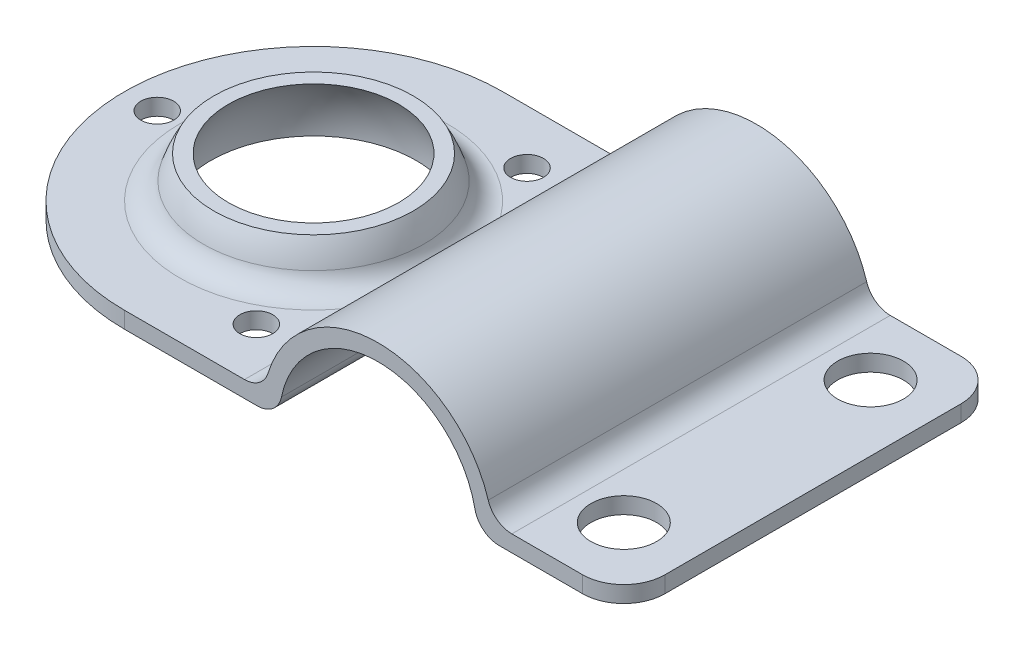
ISO-10303-21;
HEADER;
FILE_DESCRIPTION(('STEP AP214'),'2;1');
FILE_NAME('part.step','',(''),(''),'','','');
FILE_SCHEMA(('AUTOMOTIVE_DESIGN { 1 0 10303 214 1 1 1 1 }'));
ENDSEC;
DATA;
#1=APPLICATION_CONTEXT('core data for automotive mechanical design processes');
#2=APPLICATION_PROTOCOL_DEFINITION('international standard','automotive_design',2000,#1);
#3=PRODUCT_CONTEXT('',#1,'mechanical');
#4=PRODUCT('Part','Part','',(#3));
#5=PRODUCT_RELATED_PRODUCT_CATEGORY('part','',(#4));
#6=PRODUCT_DEFINITION_FORMATION('','',#4);
#7=PRODUCT_DEFINITION_CONTEXT('part definition',#1,'design');
#8=PRODUCT_DEFINITION('design','',#6,#7);
#9=PRODUCT_DEFINITION_SHAPE('','',#8);
#10=(LENGTH_UNIT() NAMED_UNIT(*) SI_UNIT(.MILLI.,.METRE.));
#11=(NAMED_UNIT(*) PLANE_ANGLE_UNIT() SI_UNIT($,.RADIAN.));
#12=(NAMED_UNIT(*) SI_UNIT($,.STERADIAN.) SOLID_ANGLE_UNIT());
#13=UNCERTAINTY_MEASURE_WITH_UNIT(LENGTH_MEASURE(1.E-05),#10,'distance_accuracy_value','');
#14=(GEOMETRIC_REPRESENTATION_CONTEXT(3) GLOBAL_UNCERTAINTY_ASSIGNED_CONTEXT((#13)) GLOBAL_UNIT_ASSIGNED_CONTEXT((#10,
#11,#12)) REPRESENTATION_CONTEXT('',''));
#15=CARTESIAN_POINT('',(0.,0.,0.));
#16=DIRECTION('',(0.,0.,1.));
#17=DIRECTION('',(1.,0.,0.));
#18=AXIS2_PLACEMENT_3D('',#15,#16,#17);
#19=CARTESIAN_POINT('',(-31.0174437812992,-2.0000000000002,23.));
#20=DIRECTION('',(-1.00000000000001,0.,0.));
#21=DIRECTION('',(0.,0.,-1.));
#22=AXIS2_PLACEMENT_3D('',#19,#20,#21);
#23=SPHERICAL_SURFACE('',#22,14.);
#24=CARTESIAN_POINT('',(-31.0174437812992,-2.0000000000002,23.));
#25=DIRECTION('',(0.,-1.,0.));
#26=DIRECTION('',(0.,0.,-1.));
#27=AXIS2_PLACEMENT_3D('',#24,#25,#26);
#28=SPHERICAL_SURFACE('',#27,14.);
#29=CARTESIAN_POINT('',(-31.0174437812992,2.11764705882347,22.9999999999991));
#30=DIRECTION('',(0.,-1.00000000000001,0.));
#31=DIRECTION('',(0.,0.,-1.));
#32=AXIS2_PLACEMENT_3D('',#29,#30,#31);
#33=CIRCLE('',#32,13.3807691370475);
#34=CARTESIAN_POINT('',(-31.0174437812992,2.11764705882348,9.61923086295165));
#35=VERTEX_POINT('',#34);
#36=EDGE_CURVE('E238',#35,#35,#33,.F.);
#37=ORIENTED_EDGE('',*,*,#36,.T.);
#38=EDGE_LOOP('',(#37));
#39=FACE_BOUND('',#38,.T.);
#40=CARTESIAN_POINT('',(-31.0174437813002,5.,22.9999999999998));
#41=DIRECTION('',(0.,1.00000000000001,0.));
#42=DIRECTION('',(-1.00000000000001,0.,0.));
#43=AXIS2_PLACEMENT_3D('',#40,#41,#42);
#44=CIRCLE('',#43,12.1243556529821);
#45=CARTESIAN_POINT('',(-43.1417994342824,5.00000000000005,22.9999999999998));
#46=VERTEX_POINT('',#45);
#47=EDGE_CURVE('E241',#46,#46,#44,.T.);
#48=ORIENTED_EDGE('',*,*,#47,.F.);
#49=EDGE_LOOP('',(#48));
#50=FACE_BOUND('',#49,.T.);
#51=ADVANCED_FACE('F30',(#39,#50),#28,.T.);
#52=CARTESIAN_POINT('',(-31.0174437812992,-2.0000000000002,23.));
#53=DIRECTION('',(1.00000000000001,0.,0.));
#54=DIRECTION('',(0.,0.,-1.));
#55=AXIS2_PLACEMENT_3D('',#52,#53,#54);
#56=SPHERICAL_SURFACE('',#55,12.5);
#57=CARTESIAN_POINT('',(-31.0174437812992,-2.0000000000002,23.));
#58=DIRECTION('',(0.,1.,0.));
#59=DIRECTION('',(0.,0.,1.));
#60=AXIS2_PLACEMENT_3D('',#57,#58,#59);
#61=SPHERICAL_SURFACE('',#60,12.5);
#62=CARTESIAN_POINT('',(-31.0174437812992,-2.0000000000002,23.));
#63=DIRECTION('',(0.,1.00000000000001,0.));
#64=DIRECTION('',(0.,0.,1.));
#65=AXIS2_PLACEMENT_3D('',#62,#63,#64);
#66=CIRCLE('',#65,12.5);
#67=CARTESIAN_POINT('',(-31.0174437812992,-2.00000000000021,35.5));
#68=VERTEX_POINT('',#67);
#69=EDGE_CURVE('E150',#68,#68,#66,.F.);
#70=ORIENTED_EDGE('',*,*,#69,.T.);
#71=EDGE_LOOP('',(#70));
#72=FACE_BOUND('',#71,.T.);
#73=CARTESIAN_POINT('',(-31.0174437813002,5.,22.9999999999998));
#74=DIRECTION('',(0.,1.00000000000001,0.));
#75=DIRECTION('',(-1.00000000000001,0.,0.));
#76=AXIS2_PLACEMENT_3D('',#73,#74,#75);
#77=CIRCLE('',#76,10.356157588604);
#78=CARTESIAN_POINT('',(-41.3736013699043,5.00000000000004,22.9999999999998));
#79=VERTEX_POINT('',#78);
#80=EDGE_CURVE('E296',#79,#79,#77,.F.);
#81=ORIENTED_EDGE('',*,*,#80,.F.);
#82=EDGE_LOOP('',(#81));
#83=FACE_BOUND('',#82,.T.);
#84=ADVANCED_FACE('F357',(#72,#83),#61,.F.);
#85=CARTESIAN_POINT('',(-54.0174437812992,-2.00000000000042,46.));
#86=DIRECTION('',(0.,1.00000000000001,0.));
#87=DIRECTION('',(0.,0.,1.));
#88=AXIS2_PLACEMENT_3D('',#85,#86,#87);
#89=PLANE('',#88);
#90=CARTESIAN_POINT('',(-21.5174437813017,-2.00000000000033,6.54551732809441));
#91=DIRECTION('',(0.,1.00000000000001,0.));
#92=DIRECTION('',(-0.866025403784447,0.,-0.499999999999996));
#93=AXIS2_PLACEMENT_3D('',#90,#91,#92);
#94=CIRCLE('',#93,2.);
#95=CARTESIAN_POINT('',(-23.2494945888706,-2.00000000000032,5.54551732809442));
#96=VERTEX_POINT('',#95);
#97=EDGE_CURVE('E323',#96,#96,#94,.T.);
#98=ORIENTED_EDGE('',*,*,#97,.T.);
#99=EDGE_LOOP('',(#98));
#100=FACE_BOUND('',#99,.T.);
#101=CARTESIAN_POINT('',(-21.5174437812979,-2.00000000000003,39.4544826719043));
#102=DIRECTION('',(0.,1.00000000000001,0.));
#103=DIRECTION('',(0.866025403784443,0.,-0.500000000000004));
#104=AXIS2_PLACEMENT_3D('',#101,#102,#103);
#105=CIRCLE('',#104,2.);
#106=CARTESIAN_POINT('',(-19.785392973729,-2.00000000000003,38.4544826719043));
#107=VERTEX_POINT('',#106);
#108=EDGE_CURVE('E317',#107,#107,#105,.T.);
#109=ORIENTED_EDGE('',*,*,#108,.T.);
#110=EDGE_LOOP('',(#109));
#111=FACE_BOUND('',#110,.T.);
#112=CARTESIAN_POINT('',(-50.0174437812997,-2.00000000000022,22.9999999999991));
#113=DIRECTION('',(0.,1.00000000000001,0.));
#114=DIRECTION('',(0.,0.,1.));
#115=AXIS2_PLACEMENT_3D('',#112,#113,#114);
#116=CIRCLE('',#115,2.);
#117=CARTESIAN_POINT('',(-50.0174437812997,-2.00000000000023,24.9999999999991));
#118=VERTEX_POINT('',#117);
#119=EDGE_CURVE('E311',#118,#118,#116,.T.);
#120=ORIENTED_EDGE('',*,*,#119,.T.);
#121=EDGE_LOOP('',(#120));
#122=FACE_BOUND('',#121,.T.);
#123=DIRECTION('',(1.00000000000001,0.,0.));
#124=VECTOR('',#123,1.);
#125=CARTESIAN_POINT('',(-54.0174437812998,-2.00000000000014,0.));
#126=LINE('',#125,#124);
#127=CARTESIAN_POINT('',(-31.0174437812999,-2.,-2.08166817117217E-13));
#128=VERTEX_POINT('',#127);
#129=CARTESIAN_POINT('',(-14.8579757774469,-2.00000000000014,-4.30211422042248E-13));
#130=VERTEX_POINT('',#129);
#131=EDGE_CURVE('E252',#128,#130,#126,.T.);
#132=ORIENTED_EDGE('',*,*,#131,.T.);
#133=DIRECTION('',(0.,0.,-1.));
#134=VECTOR('',#133,1.);
#135=CARTESIAN_POINT('',(-14.8579757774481,-2.00000000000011,46.0000000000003));
#136=LINE('',#135,#134);
#137=CARTESIAN_POINT('',(-14.8579757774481,-2.00000000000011,46.0000000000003));
#138=VERTEX_POINT('',#137);
#139=EDGE_CURVE('E190',#130,#138,#136,.F.);
#140=ORIENTED_EDGE('',*,*,#139,.T.);
#141=DIRECTION('',(1.00000000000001,0.,0.));
#142=VECTOR('',#141,1.);
#143=CARTESIAN_POINT('',(-54.0174437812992,-2.00000000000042,46.));
#144=LINE('',#143,#142);
#145=CARTESIAN_POINT('',(-31.0174437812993,-2.00000000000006,45.9999999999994));
#146=VERTEX_POINT('',#145);
#147=EDGE_CURVE('E165',#146,#138,#144,.T.);
#148=ORIENTED_EDGE('',*,*,#147,.F.);
#149=CARTESIAN_POINT('',(-31.0174437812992,-2.0000000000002,23.));
#150=DIRECTION('',(0.,1.00000000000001,0.));
#151=DIRECTION('',(0.,0.,1.));
#152=AXIS2_PLACEMENT_3D('',#149,#150,#151);
#153=CIRCLE('',#152,23.);
#154=EDGE_CURVE('E155',#128,#146,#153,.T.);
#155=ORIENTED_EDGE('',*,*,#154,.F.);
#156=EDGE_LOOP('',(#132,#140,#148,#155));
#157=FACE_BOUND('',#156,.T.);
#158=ORIENTED_EDGE('',*,*,#69,.F.);
#159=EDGE_LOOP('',(#158));
#160=FACE_BOUND('',#159,.T.);
#161=ADVANCED_FACE('F334',(#100,#111,#122,#157,#160),#89,.F.);
#162=CARTESIAN_POINT('',(-54.017443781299,-2.22044604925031E-13,45.9999999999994));
#163=DIRECTION('',(0.,1.00000000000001,0.));
#164=DIRECTION('',(0.,0.,1.));
#165=AXIS2_PLACEMENT_3D('',#162,#163,#164);
#166=PLANE('',#165);
#167=CARTESIAN_POINT('',(-21.5174437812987,-1.11022302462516E-13,6.54551732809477));
#168=DIRECTION('',(0.,1.00000000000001,0.));
#169=DIRECTION('',(-0.866025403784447,0.,-0.499999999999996));
#170=AXIS2_PLACEMENT_3D('',#167,#168,#169);
#171=CIRCLE('',#170,2.);
#172=CARTESIAN_POINT('',(-23.2494945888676,0.,5.54551732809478));
#173=VERTEX_POINT('',#172);
#174=EDGE_CURVE('E326',#173,#173,#171,.T.);
#175=ORIENTED_EDGE('',*,*,#174,.F.);
#176=EDGE_LOOP('',(#175));
#177=FACE_BOUND('',#176,.T.);
#178=CARTESIAN_POINT('',(-21.5174437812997,-2.35922392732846E-13,39.4544826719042));
#179=DIRECTION('',(0.,1.00000000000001,0.));
#180=DIRECTION('',(0.866025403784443,0.,-0.500000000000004));
#181=AXIS2_PLACEMENT_3D('',#178,#179,#180);
#182=CIRCLE('',#181,2.);
#183=CARTESIAN_POINT('',(-19.7853929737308,-2.36866082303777E-13,38.4544826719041));
#184=VERTEX_POINT('',#183);
#185=EDGE_CURVE('E320',#184,#184,#182,.T.);
#186=ORIENTED_EDGE('',*,*,#185,.F.);
#187=EDGE_LOOP('',(#186));
#188=FACE_BOUND('',#187,.T.);
#189=CARTESIAN_POINT('',(-50.0174437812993,-1.66533453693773E-13,22.9999999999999));
#190=DIRECTION('',(0.,1.00000000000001,0.));
#191=DIRECTION('',(0.,0.,1.));
#192=AXIS2_PLACEMENT_3D('',#189,#190,#191);
#193=CIRCLE('',#192,2.);
#194=CARTESIAN_POINT('',(-50.0174437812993,-1.6810858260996E-13,24.9999999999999));
#195=VERTEX_POINT('',#194);
#196=EDGE_CURVE('E314',#195,#195,#193,.T.);
#197=ORIENTED_EDGE('',*,*,#196,.F.);
#198=EDGE_LOOP('',(#197));
#199=FACE_BOUND('',#198,.T.);
#200=DIRECTION('',(0.,0.,1.));
#201=VECTOR('',#200,1.);
#202=CARTESIAN_POINT('',(-16.4091141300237,-4.9960036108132E-13,-9.71445146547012E-13));
#203=LINE('',#202,#201);
#204=CARTESIAN_POINT('',(-16.4091141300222,0.,46.));
#205=VERTEX_POINT('',#204);
#206=CARTESIAN_POINT('',(-16.4091141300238,1.11022302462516E-13,30.1131360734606));
#207=VERTEX_POINT('',#206);
#208=EDGE_CURVE('E211',#205,#207,#203,.F.);
#209=ORIENTED_EDGE('',*,*,#208,.T.);
#210=CARTESIAN_POINT('',(-31.0174437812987,-1.11022302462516E-13,22.9999999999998));
#211=DIRECTION('',(0.,1.00000000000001,0.));
#212=DIRECTION('',(0.,0.,1.));
#213=AXIS2_PLACEMENT_3D('',#210,#211,#212);
#214=CIRCLE('',#213,16.2480768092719);
#215=CARTESIAN_POINT('',(-16.4091141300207,-2.22044604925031E-13,15.8868639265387));
#216=VERTEX_POINT('',#215);
#217=EDGE_CURVE('E43',#207,#216,#214,.F.);
#218=ORIENTED_EDGE('',*,*,#217,.T.);
#219=CARTESIAN_POINT('',(-16.4091141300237,-4.9960036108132E-13,-9.71445146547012E-13));
#220=VERTEX_POINT('',#219);
#221=EDGE_CURVE('E210',#216,#220,#203,.F.);
#222=ORIENTED_EDGE('',*,*,#221,.T.);
#223=DIRECTION('',(1.00000000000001,0.,0.));
#224=VECTOR('',#223,1.);
#225=CARTESIAN_POINT('',(-54.0174437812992,-1.11022302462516E-13,2.35922392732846E-13));
#226=LINE('',#225,#224);
#227=CARTESIAN_POINT('',(-31.0174437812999,0.,-2.95596880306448E-12));
#228=VERTEX_POINT('',#227);
#229=EDGE_CURVE('E146',#228,#220,#226,.T.);
#230=ORIENTED_EDGE('',*,*,#229,.F.);
#231=CARTESIAN_POINT('',(-31.0174437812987,-1.11022302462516E-13,22.9999999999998));
#232=DIRECTION('',(0.,1.00000000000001,0.));
#233=DIRECTION('',(0.,0.,1.));
#234=AXIS2_PLACEMENT_3D('',#231,#232,#233);
#235=CIRCLE('',#234,23.);
#236=CARTESIAN_POINT('',(-31.0174437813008,-1.11022302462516E-13,45.9999999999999));
#237=VERTEX_POINT('',#236);
#238=EDGE_CURVE('E140',#228,#237,#235,.T.);
#239=ORIENTED_EDGE('',*,*,#238,.T.);
#240=DIRECTION('',(1.00000000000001,0.,0.));
#241=VECTOR('',#240,1.);
#242=CARTESIAN_POINT('',(-54.017443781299,-2.22044604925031E-13,45.9999999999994));
#243=LINE('',#242,#241);
#244=EDGE_CURVE('E144',#237,#205,#243,.T.);
#245=ORIENTED_EDGE('',*,*,#244,.T.);
#246=EDGE_LOOP('',(#209,#218,#222,#230,#239,#245));
#247=FACE_BOUND('',#246,.T.);
#248=ADVANCED_FACE('F142',(#177,#188,#199,#247),#166,.T.);
#249=CARTESIAN_POINT('',(-0.161037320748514,-2.00000000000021,45.9999999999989));
#250=DIRECTION('',(0.,0.,-1.));
#251=DIRECTION('',(-1.00000000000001,0.,0.));
#252=AXIS2_PLACEMENT_3D('',#249,#250,#251);
#253=PLANE('',#252);
#254=DIRECTION('',(1.00000000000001,0.,0.));
#255=VECTOR('',#254,1.);
#256=CARTESIAN_POINT('',(13.6953691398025,-2.00000000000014,45.9999999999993));
#257=LINE('',#256,#255);
#258=CARTESIAN_POINT('',(14.5359011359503,-2.00000000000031,45.9999999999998));
#259=VERTEX_POINT('',#258);
#260=CARTESIAN_POINT('',(24.6953691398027,-2.0000000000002,45.9999999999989));
#261=VERTEX_POINT('',#260);
#262=EDGE_CURVE('E264',#259,#261,#257,.T.);
#263=ORIENTED_EDGE('',*,*,#262,.T.);
#264=DIRECTION('',(0.,-1.00000000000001,0.));
#265=VECTOR('',#264,1.);
#266=CARTESIAN_POINT('',(24.6953691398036,-1.66533453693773E-13,46.0000000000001));
#267=LINE('',#266,#265);
#268=CARTESIAN_POINT('',(24.6953691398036,-1.66533453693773E-13,46.0000000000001));
#269=VERTEX_POINT('',#268);
#270=EDGE_CURVE('E229',#261,#269,#267,.F.);
#271=ORIENTED_EDGE('',*,*,#270,.T.);
#272=DIRECTION('',(1.00000000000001,0.,0.));
#273=VECTOR('',#272,1.);
#274=CARTESIAN_POINT('',(13.6953691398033,0.,46.0000000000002));
#275=LINE('',#274,#273);
#276=CARTESIAN_POINT('',(16.0870394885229,0.,45.9999999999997));
#277=VERTEX_POINT('',#276);
#278=EDGE_CURVE('E171',#277,#269,#275,.T.);
#279=ORIENTED_EDGE('',*,*,#278,.F.);
#280=CARTESIAN_POINT('',(16.0870394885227,2.9999999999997,45.9999999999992));
#281=DIRECTION('',(0.,0.,-1.));
#282=DIRECTION('',(-1.00000000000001,0.,0.));
#283=AXIS2_PLACEMENT_3D('',#280,#281,#282);
#284=CIRCLE('',#283,3.);
#285=CARTESIAN_POINT('',(13.2197318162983,2.11764705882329,45.9999999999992));
#286=VERTEX_POINT('',#285);
#287=EDGE_CURVE('E215',#277,#286,#284,.T.);
#288=ORIENTED_EDGE('',*,*,#287,.T.);
#289=CARTESIAN_POINT('',(-0.161037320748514,-2.00000000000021,45.9999999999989));
#290=DIRECTION('',(0.,0.,-1.));
#291=DIRECTION('',(1.00000000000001,0.,0.));
#292=AXIS2_PLACEMENT_3D('',#289,#290,#291);
#293=CIRCLE('',#292,14.);
#294=CARTESIAN_POINT('',(-13.5418064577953,2.11764705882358,45.9999999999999));
#295=VERTEX_POINT('',#294);
#296=EDGE_CURVE('E166',#295,#286,#293,.T.);
#297=ORIENTED_EDGE('',*,*,#296,.F.);
#298=CARTESIAN_POINT('',(-16.4091141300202,2.99999999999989,45.9999999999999));
#299=DIRECTION('',(0.,0.,-1.));
#300=DIRECTION('',(-1.00000000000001,0.,0.));
#301=AXIS2_PLACEMENT_3D('',#298,#299,#300);
#302=CIRCLE('',#301,3.);
#303=EDGE_CURVE('E164',#295,#205,#302,.T.);
#304=ORIENTED_EDGE('',*,*,#303,.T.);
#305=ORIENTED_EDGE('',*,*,#244,.F.);
#306=DIRECTION('',(0.,1.00000000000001,0.));
#307=VECTOR('',#306,1.);
#308=CARTESIAN_POINT('',(-31.0174437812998,-46.0000000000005,45.9999999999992));
#309=LINE('',#308,#307);
#310=EDGE_CURVE('E149',#146,#237,#309,.T.);
#311=ORIENTED_EDGE('',*,*,#310,.F.);
#312=ORIENTED_EDGE('',*,*,#147,.T.);
#313=CARTESIAN_POINT('',(-14.8579757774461,0.999999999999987,45.9999999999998));
#314=DIRECTION('',(0.,0.,-1.));
#315=DIRECTION('',(-1.00000000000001,0.,0.));
#316=AXIS2_PLACEMENT_3D('',#313,#314,#315);
#317=CIRCLE('',#316,3.);
#318=CARTESIAN_POINT('',(-11.9185880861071,0.399999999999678,45.9999999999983));
#319=VERTEX_POINT('',#318);
#320=EDGE_CURVE('E192',#138,#319,#317,.F.);
#321=ORIENTED_EDGE('',*,*,#320,.T.);
#322=CARTESIAN_POINT('',(-0.161037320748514,-2.00000000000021,45.9999999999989));
#323=DIRECTION('',(0.,0.,1.));
#324=DIRECTION('',(1.00000000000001,0.,0.));
#325=AXIS2_PLACEMENT_3D('',#322,#323,#324);
#326=CIRCLE('',#325,12.);
#327=CARTESIAN_POINT('',(11.596513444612,0.399999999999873,45.9999999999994));
#328=VERTEX_POINT('',#327);
#329=EDGE_CURVE('E168',#319,#328,#326,.F.);
#330=ORIENTED_EDGE('',*,*,#329,.T.);
#331=CARTESIAN_POINT('',(14.5359011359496,0.999999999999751,45.9999999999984));
#332=DIRECTION('',(0.,0.,-1.));
#333=DIRECTION('',(-1.00000000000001,0.,0.));
#334=AXIS2_PLACEMENT_3D('',#331,#332,#333);
#335=CIRCLE('',#334,3.);
#336=EDGE_CURVE('E201',#328,#259,#335,.F.);
#337=ORIENTED_EDGE('',*,*,#336,.T.);
#338=EDGE_LOOP('',(#263,#271,#279,#288,#297,#304,#305,#311,#312,#321,#330,#337));
#339=FACE_BOUND('',#338,.T.);
#340=ADVANCED_FACE('F161',(#339),#253,.F.);
#341=CARTESIAN_POINT('',(-0.161037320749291,-2.0000000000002,-2.33146835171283E-12));
#342=DIRECTION('',(0.,0.,-1.));
#343=DIRECTION('',(-1.00000000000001,0.,0.));
#344=AXIS2_PLACEMENT_3D('',#341,#342,#343);
#345=PLANE('',#344);
#346=DIRECTION('',(1.00000000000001,0.,0.));
#347=VECTOR('',#346,1.);
#348=CARTESIAN_POINT('',(13.695369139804,0.,0.));
#349=LINE('',#348,#347);
#350=CARTESIAN_POINT('',(16.0870394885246,0.,0.));
#351=VERTEX_POINT('',#350);
#352=CARTESIAN_POINT('',(24.695369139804,0.,0.));
#353=VERTEX_POINT('',#352);
#354=EDGE_CURVE('E258',#351,#353,#349,.T.);
#355=ORIENTED_EDGE('',*,*,#354,.T.);
#356=DIRECTION('',(0.,-1.00000000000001,0.));
#357=VECTOR('',#356,1.);
#358=CARTESIAN_POINT('',(24.695369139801,-2.00000000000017,4.44089209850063E-13));
#359=LINE('',#358,#357);
#360=CARTESIAN_POINT('',(24.695369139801,-2.00000000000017,4.44089209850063E-13));
#361=VERTEX_POINT('',#360);
#362=EDGE_CURVE('E235',#353,#361,#359,.T.);
#363=ORIENTED_EDGE('',*,*,#362,.T.);
#364=DIRECTION('',(1.00000000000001,0.,0.));
#365=VECTOR('',#364,1.);
#366=CARTESIAN_POINT('',(13.6953691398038,-2.00000000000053,0.));
#367=LINE('',#366,#365);
#368=CARTESIAN_POINT('',(14.5359011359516,-2.00000000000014,0.));
#369=VERTEX_POINT('',#368);
#370=EDGE_CURVE('E286',#369,#361,#367,.T.);
#371=ORIENTED_EDGE('',*,*,#370,.F.);
#372=CARTESIAN_POINT('',(14.5359011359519,0.999999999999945,0.));
#373=DIRECTION('',(0.,0.,-1.));
#374=DIRECTION('',(-1.00000000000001,0.,0.));
#375=AXIS2_PLACEMENT_3D('',#372,#373,#374);
#376=CIRCLE('',#375,3.);
#377=CARTESIAN_POINT('',(11.5965134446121,0.3999999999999,-1.11022302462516E-12));
#378=VERTEX_POINT('',#377);
#379=EDGE_CURVE('E197',#369,#378,#376,.T.);
#380=ORIENTED_EDGE('',*,*,#379,.T.);
#381=CARTESIAN_POINT('',(-0.161037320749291,-2.0000000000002,-2.33146835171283E-12));
#382=DIRECTION('',(0.,0.,1.));
#383=DIRECTION('',(1.00000000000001,0.,0.));
#384=AXIS2_PLACEMENT_3D('',#381,#382,#383);
#385=CIRCLE('',#384,12.);
#386=CARTESIAN_POINT('',(-11.9185880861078,0.399999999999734,2.63677968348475E-13));
#387=VERTEX_POINT('',#386);
#388=EDGE_CURVE('E256',#387,#378,#385,.F.);
#389=ORIENTED_EDGE('',*,*,#388,.F.);
#390=CARTESIAN_POINT('',(-14.8579757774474,0.999999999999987,0.));
#391=DIRECTION('',(0.,0.,-1.));
#392=DIRECTION('',(-1.00000000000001,0.,0.));
#393=AXIS2_PLACEMENT_3D('',#390,#391,#392);
#394=CIRCLE('',#393,3.);
#395=EDGE_CURVE('E188',#387,#130,#394,.T.);
#396=ORIENTED_EDGE('',*,*,#395,.T.);
#397=ORIENTED_EDGE('',*,*,#131,.F.);
#398=DIRECTION('',(0.,1.00000000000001,0.));
#399=VECTOR('',#398,1.);
#400=CARTESIAN_POINT('',(-31.0174437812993,-46.0000000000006,0.));
#401=LINE('',#400,#399);
#402=EDGE_CURVE('E183',#128,#228,#401,.T.);
#403=ORIENTED_EDGE('',*,*,#402,.T.);
#404=ORIENTED_EDGE('',*,*,#229,.T.);
#405=CARTESIAN_POINT('',(-16.4091141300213,2.99999999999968,1.80411241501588E-13));
#406=DIRECTION('',(0.,0.,-1.));
#407=DIRECTION('',(-1.00000000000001,0.,0.));
#408=AXIS2_PLACEMENT_3D('',#405,#406,#407);
#409=CIRCLE('',#408,3.);
#410=CARTESIAN_POINT('',(-13.5418064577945,2.11764705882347,0.));
#411=VERTEX_POINT('',#410);
#412=EDGE_CURVE('E217',#220,#411,#409,.F.);
#413=ORIENTED_EDGE('',*,*,#412,.T.);
#414=CARTESIAN_POINT('',(-0.161037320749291,-2.0000000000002,-2.33146835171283E-12));
#415=DIRECTION('',(0.,0.,-1.));
#416=DIRECTION('',(1.00000000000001,0.,0.));
#417=AXIS2_PLACEMENT_3D('',#414,#415,#416);
#418=CIRCLE('',#417,14.);
#419=CARTESIAN_POINT('',(13.2197318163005,2.11764705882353,0.));
#420=VERTEX_POINT('',#419);
#421=EDGE_CURVE('E253',#411,#420,#418,.T.);
#422=ORIENTED_EDGE('',*,*,#421,.T.);
#423=CARTESIAN_POINT('',(16.087039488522,2.99999999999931,-1.49880108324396E-12));
#424=DIRECTION('',(0.,0.,-1.));
#425=DIRECTION('',(-1.00000000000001,0.,0.));
#426=AXIS2_PLACEMENT_3D('',#423,#424,#425);
#427=CIRCLE('',#426,3.);
#428=EDGE_CURVE('E213',#420,#351,#427,.F.);
#429=ORIENTED_EDGE('',*,*,#428,.T.);
#430=EDGE_LOOP('',(#355,#363,#371,#380,#389,#396,#397,#403,#404,#413,#422,#429));
#431=FACE_BOUND('',#430,.T.);
#432=ADVANCED_FACE('F250',(#431),#345,.T.);
#433=CARTESIAN_POINT('',(13.6953691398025,-2.00000000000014,45.9999999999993));
#434=DIRECTION('',(0.,1.00000000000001,0.));
#435=DIRECTION('',(0.,0.,1.));
#436=AXIS2_PLACEMENT_3D('',#433,#434,#435);
#437=PLANE('',#436);
#438=CARTESIAN_POINT('',(21.6953691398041,-2.00000000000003,38.));
#439=DIRECTION('',(0.,1.00000000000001,0.));
#440=DIRECTION('',(0.,0.,1.));
#441=AXIS2_PLACEMENT_3D('',#438,#439,#440);
#442=CIRCLE('',#441,4.);
#443=CARTESIAN_POINT('',(21.6953691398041,-2.00000000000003,42.));
#444=VERTEX_POINT('',#443);
#445=EDGE_CURVE('E305',#444,#444,#442,.T.);
#446=ORIENTED_EDGE('',*,*,#445,.T.);
#447=EDGE_LOOP('',(#446));
#448=FACE_BOUND('',#447,.T.);
#449=CARTESIAN_POINT('',(21.6953691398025,-2.00000000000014,7.99999999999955));
#450=DIRECTION('',(0.,1.00000000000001,0.));
#451=DIRECTION('',(0.,0.,1.));
#452=AXIS2_PLACEMENT_3D('',#449,#450,#451);
#453=CIRCLE('',#452,4.);
#454=CARTESIAN_POINT('',(21.6953691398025,-2.00000000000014,11.9999999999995));
#455=VERTEX_POINT('',#454);
#456=EDGE_CURVE('E299',#455,#455,#453,.T.);
#457=ORIENTED_EDGE('',*,*,#456,.T.);
#458=EDGE_LOOP('',(#457));
#459=FACE_BOUND('',#458,.T.);
#460=DIRECTION('',(0.,0.,-1.));
#461=VECTOR('',#460,1.);
#462=CARTESIAN_POINT('',(29.6953691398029,-2.00000000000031,45.9999999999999));
#463=LINE('',#462,#461);
#464=CARTESIAN_POINT('',(29.6953691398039,-2.,41.0000000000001));
#465=VERTEX_POINT('',#464);
#466=CARTESIAN_POINT('',(29.6953691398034,-2.00000000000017,4.99999999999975));
#467=VERTEX_POINT('',#466);
#468=EDGE_CURVE('E180',#465,#467,#463,.T.);
#469=ORIENTED_EDGE('',*,*,#468,.F.);
#470=CARTESIAN_POINT('',(24.6953691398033,-2.00000000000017,40.9999999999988));
#471=DIRECTION('',(0.,1.00000000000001,0.));
#472=DIRECTION('',(0.,0.,1.));
#473=AXIS2_PLACEMENT_3D('',#470,#471,#472);
#474=CIRCLE('',#473,5.);
#475=EDGE_CURVE('E227',#465,#261,#474,.F.);
#476=ORIENTED_EDGE('',*,*,#475,.T.);
#477=ORIENTED_EDGE('',*,*,#262,.F.);
#478=DIRECTION('',(0.,0.,-1.));
#479=VECTOR('',#478,1.);
#480=CARTESIAN_POINT('',(14.5359011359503,-2.00000000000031,45.9999999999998));
#481=LINE('',#480,#479);
#482=EDGE_CURVE('E194',#259,#369,#481,.T.);
#483=ORIENTED_EDGE('',*,*,#482,.T.);
#484=ORIENTED_EDGE('',*,*,#370,.T.);
#485=CARTESIAN_POINT('',(24.6953691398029,-2.00000000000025,5.0000000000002));
#486=DIRECTION('',(0.,1.00000000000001,0.));
#487=DIRECTION('',(0.,0.,1.));
#488=AXIS2_PLACEMENT_3D('',#485,#486,#487);
#489=CIRCLE('',#488,5.);
#490=EDGE_CURVE('E225',#361,#467,#489,.F.);
#491=ORIENTED_EDGE('',*,*,#490,.T.);
#492=EDGE_LOOP('',(#469,#476,#477,#483,#484,#491));
#493=FACE_BOUND('',#492,.T.);
#494=ADVANCED_FACE('F32',(#448,#459,#493),#437,.F.);
#495=CARTESIAN_POINT('',(29.6953691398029,-1.11022302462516E-13,45.9999999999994));
#496=DIRECTION('',(1.00000000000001,0.,0.));
#497=DIRECTION('',(0.,0.,-1.));
#498=AXIS2_PLACEMENT_3D('',#495,#496,#497);
#499=PLANE('',#498);
#500=DIRECTION('',(0.,0.,-1.));
#501=VECTOR('',#500,1.);
#502=CARTESIAN_POINT('',(29.6953691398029,-1.11022302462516E-13,45.9999999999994));
#503=LINE('',#502,#501);
#504=CARTESIAN_POINT('',(29.6953691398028,-2.22044604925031E-13,40.9999999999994));
#505=VERTEX_POINT('',#504);
#506=CARTESIAN_POINT('',(29.6953691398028,-6.93889390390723E-13,4.99999999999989));
#507=VERTEX_POINT('',#506);
#508=EDGE_CURVE('E177',#505,#507,#503,.T.);
#509=ORIENTED_EDGE('',*,*,#508,.F.);
#510=DIRECTION('',(0.,-1.00000000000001,0.));
#511=VECTOR('',#510,1.);
#512=CARTESIAN_POINT('',(29.6953691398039,-2.,41.0000000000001));
#513=LINE('',#512,#511);
#514=EDGE_CURVE('E222',#505,#465,#513,.T.);
#515=ORIENTED_EDGE('',*,*,#514,.T.);
#516=ORIENTED_EDGE('',*,*,#468,.T.);
#517=DIRECTION('',(0.,-1.00000000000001,0.));
#518=VECTOR('',#517,1.);
#519=CARTESIAN_POINT('',(29.6953691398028,-6.93889390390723E-13,4.99999999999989));
#520=LINE('',#519,#518);
#521=EDGE_CURVE('E220',#467,#507,#520,.F.);
#522=ORIENTED_EDGE('',*,*,#521,.T.);
#523=EDGE_LOOP('',(#509,#515,#516,#522));
#524=FACE_BOUND('',#523,.T.);
#525=ADVANCED_FACE('F280',(#524),#499,.T.);
#526=CARTESIAN_POINT('',(13.6953691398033,0.,46.0000000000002));
#527=DIRECTION('',(0.,1.00000000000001,0.));
#528=DIRECTION('',(0.,0.,1.));
#529=AXIS2_PLACEMENT_3D('',#526,#527,#528);
#530=PLANE('',#529);
#531=CARTESIAN_POINT('',(21.6953691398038,-2.91433543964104E-13,37.9999999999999));
#532=DIRECTION('',(0.,1.00000000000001,0.));
#533=DIRECTION('',(0.,0.,1.));
#534=AXIS2_PLACEMENT_3D('',#531,#532,#533);
#535=CIRCLE('',#534,4.);
#536=CARTESIAN_POINT('',(21.6953691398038,-2.94583801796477E-13,41.9999999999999));
#537=VERTEX_POINT('',#536);
#538=EDGE_CURVE('E308',#537,#537,#535,.T.);
#539=ORIENTED_EDGE('',*,*,#538,.F.);
#540=EDGE_LOOP('',(#539));
#541=FACE_BOUND('',#540,.T.);
#542=CARTESIAN_POINT('',(21.6953691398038,0.,7.99999999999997));
#543=DIRECTION('',(0.,1.00000000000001,0.));
#544=DIRECTION('',(0.,0.,1.));
#545=AXIS2_PLACEMENT_3D('',#542,#543,#544);
#546=CIRCLE('',#545,4.);
#547=CARTESIAN_POINT('',(21.6953691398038,0.,12.));
#548=VERTEX_POINT('',#547);
#549=EDGE_CURVE('E302',#548,#548,#546,.T.);
#550=ORIENTED_EDGE('',*,*,#549,.F.);
#551=EDGE_LOOP('',(#550));
#552=FACE_BOUND('',#551,.T.);
#553=ORIENTED_EDGE('',*,*,#278,.T.);
#554=CARTESIAN_POINT('',(24.6953691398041,0.,41.));
#555=DIRECTION('',(0.,1.00000000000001,0.));
#556=DIRECTION('',(0.,0.,1.));
#557=AXIS2_PLACEMENT_3D('',#554,#555,#556);
#558=CIRCLE('',#557,5.);
#559=EDGE_CURVE('E233',#269,#505,#558,.T.);
#560=ORIENTED_EDGE('',*,*,#559,.T.);
#561=ORIENTED_EDGE('',*,*,#508,.T.);
#562=CARTESIAN_POINT('',(24.6953691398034,0.,4.99999999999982));
#563=DIRECTION('',(0.,1.00000000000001,0.));
#564=DIRECTION('',(0.,0.,1.));
#565=AXIS2_PLACEMENT_3D('',#562,#563,#564);
#566=CIRCLE('',#565,5.);
#567=EDGE_CURVE('E231',#507,#353,#566,.T.);
#568=ORIENTED_EDGE('',*,*,#567,.T.);
#569=ORIENTED_EDGE('',*,*,#354,.F.);
#570=DIRECTION('',(0.,0.,1.));
#571=VECTOR('',#570,1.);
#572=CARTESIAN_POINT('',(16.0870394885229,0.,45.9999999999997));
#573=LINE('',#572,#571);
#574=EDGE_CURVE('E208',#351,#277,#573,.T.);
#575=ORIENTED_EDGE('',*,*,#574,.T.);
#576=EDGE_LOOP('',(#553,#560,#561,#568,#569,#575));
#577=FACE_BOUND('',#576,.T.);
#578=ADVANCED_FACE('F269',(#541,#552,#577),#530,.T.);
#579=CARTESIAN_POINT('',(-0.161037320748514,-2.00000000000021,45.9999999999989));
#580=DIRECTION('',(0.,0.,-1.));
#581=DIRECTION('',(-1.00000000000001,0.,0.));
#582=AXIS2_PLACEMENT_3D('',#579,#580,#581);
#583=CYLINDRICAL_SURFACE('',#582,14.);
#584=ORIENTED_EDGE('',*,*,#296,.T.);
#585=DIRECTION('',(0.,0.,-1.));
#586=VECTOR('',#585,1.);
#587=CARTESIAN_POINT('',(13.2197318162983,2.11764705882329,45.9999999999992));
#588=LINE('',#587,#586);
#589=EDGE_CURVE('E205',#286,#420,#588,.T.);
#590=ORIENTED_EDGE('',*,*,#589,.T.);
#591=ORIENTED_EDGE('',*,*,#421,.F.);
#592=DIRECTION('',(0.,0.,-1.));
#593=VECTOR('',#592,1.);
#594=CARTESIAN_POINT('',(-13.5418064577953,2.11764705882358,45.9999999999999));
#595=LINE('',#594,#593);
#596=EDGE_CURVE('E203',#411,#295,#595,.F.);
#597=ORIENTED_EDGE('',*,*,#596,.T.);
#598=EDGE_LOOP('',(#584,#590,#591,#597));
#599=FACE_BOUND('',#598,.T.);
#600=ADVANCED_FACE('F395',(#599),#583,.T.);
#601=CARTESIAN_POINT('',(-0.161037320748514,-2.00000000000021,45.9999999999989));
#602=DIRECTION('',(0.,0.,-1.));
#603=DIRECTION('',(-1.00000000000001,0.,0.));
#604=AXIS2_PLACEMENT_3D('',#601,#602,#603);
#605=CYLINDRICAL_SURFACE('',#604,12.);
#606=ORIENTED_EDGE('',*,*,#388,.T.);
#607=DIRECTION('',(0.,0.,-1.));
#608=VECTOR('',#607,1.);
#609=CARTESIAN_POINT('',(11.596513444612,0.399999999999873,45.9999999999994));
#610=LINE('',#609,#608);
#611=EDGE_CURVE('E199',#378,#328,#610,.F.);
#612=ORIENTED_EDGE('',*,*,#611,.T.);
#613=ORIENTED_EDGE('',*,*,#329,.F.);
#614=DIRECTION('',(0.,0.,-1.));
#615=VECTOR('',#614,1.);
#616=CARTESIAN_POINT('',(-11.9185880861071,0.399999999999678,45.9999999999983));
#617=LINE('',#616,#615);
#618=EDGE_CURVE('E185',#319,#387,#617,.T.);
#619=ORIENTED_EDGE('',*,*,#618,.T.);
#620=EDGE_LOOP('',(#606,#612,#613,#619));
#621=FACE_BOUND('',#620,.T.);
#622=ADVANCED_FACE('F388',(#621),#605,.F.);
#623=CARTESIAN_POINT('',(-31.0174437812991,-46.0000000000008,23.0000000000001));
#624=DIRECTION('',(0.,1.00000000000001,0.));
#625=DIRECTION('',(0.,0.,1.));
#626=AXIS2_PLACEMENT_3D('',#623,#624,#625);
#627=CYLINDRICAL_SURFACE('',#626,23.);
#628=ORIENTED_EDGE('',*,*,#154,.T.);
#629=ORIENTED_EDGE('',*,*,#310,.T.);
#630=ORIENTED_EDGE('',*,*,#238,.F.);
#631=ORIENTED_EDGE('',*,*,#402,.F.);
#632=EDGE_LOOP('',(#628,#629,#630,#631));
#633=FACE_BOUND('',#632,.T.);
#634=ADVANCED_FACE('F153',(#633),#627,.T.);
#635=CARTESIAN_POINT('',(-14.8579757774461,0.999999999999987,45.9999999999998));
#636=DIRECTION('',(0.,0.,-1.));
#637=DIRECTION('',(-1.00000000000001,0.,0.));
#638=AXIS2_PLACEMENT_3D('',#635,#636,#637);
#639=CYLINDRICAL_SURFACE('',#638,3.);
#640=ORIENTED_EDGE('',*,*,#320,.F.);
#641=ORIENTED_EDGE('',*,*,#139,.F.);
#642=ORIENTED_EDGE('',*,*,#395,.F.);
#643=ORIENTED_EDGE('',*,*,#618,.F.);
#644=EDGE_LOOP('',(#640,#641,#642,#643));
#645=FACE_BOUND('',#644,.T.);
#646=ADVANCED_FACE('F381',(#645),#639,.T.);
#647=CARTESIAN_POINT('',(14.5359011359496,0.999999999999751,45.9999999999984));
#648=DIRECTION('',(0.,0.,-1.));
#649=DIRECTION('',(-1.00000000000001,0.,0.));
#650=AXIS2_PLACEMENT_3D('',#647,#648,#649);
#651=CYLINDRICAL_SURFACE('',#650,3.);
#652=ORIENTED_EDGE('',*,*,#336,.F.);
#653=ORIENTED_EDGE('',*,*,#611,.F.);
#654=ORIENTED_EDGE('',*,*,#379,.F.);
#655=ORIENTED_EDGE('',*,*,#482,.F.);
#656=EDGE_LOOP('',(#652,#653,#654,#655));
#657=FACE_BOUND('',#656,.T.);
#658=ADVANCED_FACE('F377',(#657),#651,.T.);
#659=CARTESIAN_POINT('',(16.0870394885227,2.9999999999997,45.9999999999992));
#660=DIRECTION('',(0.,0.,-1.));
#661=DIRECTION('',(-1.00000000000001,0.,0.));
#662=AXIS2_PLACEMENT_3D('',#659,#660,#661);
#663=CYLINDRICAL_SURFACE('',#662,3.);
#664=ORIENTED_EDGE('',*,*,#287,.F.);
#665=ORIENTED_EDGE('',*,*,#574,.F.);
#666=ORIENTED_EDGE('',*,*,#428,.F.);
#667=ORIENTED_EDGE('',*,*,#589,.F.);
#668=EDGE_LOOP('',(#664,#665,#666,#667));
#669=FACE_BOUND('',#668,.T.);
#670=ADVANCED_FACE('F374',(#669),#663,.F.);
#671=CARTESIAN_POINT('',(-16.4091141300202,2.99999999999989,45.9999999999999));
#672=DIRECTION('',(0.,0.,-1.));
#673=DIRECTION('',(-1.00000000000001,0.,0.));
#674=AXIS2_PLACEMENT_3D('',#671,#672,#673);
#675=CYLINDRICAL_SURFACE('',#674,3.);
#676=ORIENTED_EDGE('',*,*,#221,.F.);
#677=CARTESIAN_POINT('',(-16.4091141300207,-2.22044604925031E-13,15.8868639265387));
#678=CARTESIAN_POINT('',(-16.407874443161,6.95169622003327E-09,15.8922416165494));
#679=CARTESIAN_POINT('',(-16.4066360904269,7.75208847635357E-07,15.8976196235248));
#680=CARTESIAN_POINT('',(-16.2926799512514,0.000141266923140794,16.3930796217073));
#681=CARTESIAN_POINT('',(-16.1910432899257,0.00656414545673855,16.8857863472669));
#682=CARTESIAN_POINT('',(-16.0108178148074,0.025178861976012,17.8753828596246));
#683=CARTESIAN_POINT('',(-15.9322366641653,0.0373726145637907,18.3722739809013));
#684=CARTESIAN_POINT('',(-15.7988120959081,0.0619460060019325,19.3693358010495));
#685=CARTESIAN_POINT('',(-15.7439715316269,0.074325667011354,19.869506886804));
#686=CARTESIAN_POINT('',(-15.6799113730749,0.089893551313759,20.6212650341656));
#687=CARTESIAN_POINT('',(-15.661592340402,0.0945822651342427,20.8720766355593));
#688=CARTESIAN_POINT('',(-15.6310568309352,0.102607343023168,21.3740899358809));
#689=CARTESIAN_POINT('',(-15.6188400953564,0.105943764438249,21.625291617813));
#690=CARTESIAN_POINT('',(-15.6028766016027,0.110358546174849,22.0637575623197));
#691=CARTESIAN_POINT('',(-15.5977636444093,0.111795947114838,22.2509699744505));
#692=CARTESIAN_POINT('',(-15.5909456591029,0.113719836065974,22.6254544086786));
#693=CARTESIAN_POINT('',(-15.5892404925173,0.114206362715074,22.8127264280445));
#694=CARTESIAN_POINT('',(-15.5892406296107,0.114205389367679,23.2515464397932));
#695=CARTESIAN_POINT('',(-15.5923172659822,0.113326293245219,23.5030956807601));
#696=CARTESIAN_POINT('',(-15.6046161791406,0.109875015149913,24.0060404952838));
#697=CARTESIAN_POINT('',(-15.6138387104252,0.107302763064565,24.2574360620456));
#698=CARTESIAN_POINT('',(-15.6384092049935,0.100659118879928,24.7599659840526));
#699=CARTESIAN_POINT('',(-15.6537585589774,0.0965873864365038,25.0111002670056));
#700=CARTESIAN_POINT('',(-15.6905439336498,0.08726759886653,25.51290337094));
#701=CARTESIAN_POINT('',(-15.711980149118,0.0820195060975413,25.7635721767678));
#702=CARTESIAN_POINT('',(-15.7853538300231,0.0651251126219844,26.5147438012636));
#703=CARTESIAN_POINT('',(-15.846353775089,0.0523295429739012,27.01435989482));
#704=CARTESIAN_POINT('',(-15.9919582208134,0.0282309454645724,28.0100537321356));
#705=CARTESIAN_POINT('',(-16.0765567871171,0.0169275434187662,28.5061323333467));
#706=CARTESIAN_POINT('',(-16.2082667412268,0.00651910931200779,29.183489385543));
#707=CARTESIAN_POINT('',(-16.2455237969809,0.00421231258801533,29.3666735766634));
#708=CARTESIAN_POINT('',(-16.3231437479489,0.000979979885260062,29.7323581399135));
#709=CARTESIAN_POINT('',(-16.3635059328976,5.4129011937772E-05,29.9148586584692));
#710=CARTESIAN_POINT('',(-16.4066360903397,7.69879932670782E-07,30.1023803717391));
#711=CARTESIAN_POINT('',(-16.4078744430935,1.5433516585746E-09,30.1077583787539));
#712=CARTESIAN_POINT('',(-16.4091141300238,1.11022302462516E-13,30.1131360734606));
#713=B_SPLINE_CURVE_WITH_KNOTS('',3,(#677,#678,#679,#680,#681,#682,#683,#684,#685,#686,#687,
#688,#689,#690,#691,#692,#693,#694,#695,#696,#697,#698,#699,#700,#701,#702,#703,#704,#705,#706,
#707,#708,#709,#710,#711,#712),.UNSPECIFIED.,.F.,.F.,(4,2,2,2,2,2,2,2,2,2,2,2,2,2,2,2,2,4),(0.,
0.0165562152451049,1.52518585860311,3.03431637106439,4.54362821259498,5.29813597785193,
6.05261174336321,6.61444372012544,7.1762528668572,7.93087664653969,8.68553167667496,
9.44035810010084,10.1952086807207,11.7050656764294,13.2145433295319,13.7753679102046,
14.3360645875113,14.3526208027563),.UNSPECIFIED.);
#714=EDGE_CURVE('E11',#216,#207,#713,.T.);
#715=ORIENTED_EDGE('',*,*,#714,.T.);
#716=ORIENTED_EDGE('',*,*,#208,.F.);
#717=ORIENTED_EDGE('',*,*,#303,.F.);
#718=ORIENTED_EDGE('',*,*,#596,.F.);
#719=ORIENTED_EDGE('',*,*,#412,.F.);
#720=EDGE_LOOP('',(#676,#715,#716,#717,#718,#719));
#721=FACE_BOUND('',#720,.T.);
#722=ADVANCED_FACE('F244',(#721),#675,.F.);
#723=CARTESIAN_POINT('',(24.6953691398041,0.,41.));
#724=DIRECTION('',(0.,1.00000000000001,0.));
#725=DIRECTION('',(0.,0.,1.));
#726=AXIS2_PLACEMENT_3D('',#723,#724,#725);
#727=CYLINDRICAL_SURFACE('',#726,5.);
#728=ORIENTED_EDGE('',*,*,#559,.F.);
#729=ORIENTED_EDGE('',*,*,#270,.F.);
#730=ORIENTED_EDGE('',*,*,#475,.F.);
#731=ORIENTED_EDGE('',*,*,#514,.F.);
#732=EDGE_LOOP('',(#728,#729,#730,#731));
#733=FACE_BOUND('',#732,.T.);
#734=ADVANCED_FACE('F277',(#733),#727,.T.);
#735=CARTESIAN_POINT('',(24.6953691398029,-2.00000000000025,5.0000000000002));
#736=DIRECTION('',(0.,-1.00000000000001,0.));
#737=DIRECTION('',(0.,0.,-1.));
#738=AXIS2_PLACEMENT_3D('',#735,#736,#737);
#739=CYLINDRICAL_SURFACE('',#738,5.);
#740=ORIENTED_EDGE('',*,*,#567,.F.);
#741=ORIENTED_EDGE('',*,*,#521,.F.);
#742=ORIENTED_EDGE('',*,*,#490,.F.);
#743=ORIENTED_EDGE('',*,*,#362,.F.);
#744=EDGE_LOOP('',(#740,#741,#742,#743));
#745=FACE_BOUND('',#744,.T.);
#746=ADVANCED_FACE('F290',(#745),#739,.T.);
#747=CARTESIAN_POINT('',(-31.0174437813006,2.99999999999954,23.0000000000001));
#748=DIRECTION('',(0.,1.00000000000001,0.));
#749=DIRECTION('',(0.,0.,1.));
#750=AXIS2_PLACEMENT_3D('',#747,#748,#749);
#751=TOROIDAL_SURFACE('',#750,16.2480768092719,3.);
#752=ORIENTED_EDGE('',*,*,#714,.F.);
#753=ORIENTED_EDGE('',*,*,#217,.F.);
#754=EDGE_LOOP('',(#752,#753));
#755=FACE_BOUND('',#754,.T.);
#756=ORIENTED_EDGE('',*,*,#36,.F.);
#757=EDGE_LOOP('',(#756));
#758=FACE_BOUND('',#757,.T.);
#759=ADVANCED_FACE('F369',(#755,#758),#751,.F.);
#760=CARTESIAN_POINT('',(-54.0184437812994,5.00000000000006,-1.80411241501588E-13));
#761=DIRECTION('',(0.,1.00000000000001,0.));
#762=DIRECTION('',(-1.00000000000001,0.,0.));
#763=AXIS2_PLACEMENT_3D('',#760,#761,#762);
#764=PLANE('',#763);
#765=ORIENTED_EDGE('',*,*,#47,.T.);
#766=EDGE_LOOP('',(#765));
#767=FACE_BOUND('',#766,.T.);
#768=ORIENTED_EDGE('',*,*,#80,.T.);
#769=EDGE_LOOP('',(#768));
#770=FACE_BOUND('',#769,.T.);
#771=ADVANCED_FACE('F418',(#767,#770),#764,.T.);
#772=CARTESIAN_POINT('',(21.6953691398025,-2.00000000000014,7.99999999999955));
#773=DIRECTION('',(0.,1.00000000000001,0.));
#774=DIRECTION('',(0.,0.,1.));
#775=AXIS2_PLACEMENT_3D('',#772,#773,#774);
#776=CYLINDRICAL_SURFACE('',#775,4.);
#777=ORIENTED_EDGE('',*,*,#456,.F.);
#778=EDGE_LOOP('',(#777));
#779=FACE_BOUND('',#778,.T.);
#780=ORIENTED_EDGE('',*,*,#549,.T.);
#781=EDGE_LOOP('',(#780));
#782=FACE_BOUND('',#781,.T.);
#783=ADVANCED_FACE('F352',(#779,#782),#776,.F.);
#784=CARTESIAN_POINT('',(21.6953691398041,-2.00000000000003,38.));
#785=DIRECTION('',(0.,1.00000000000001,0.));
#786=DIRECTION('',(0.,0.,1.));
#787=AXIS2_PLACEMENT_3D('',#784,#785,#786);
#788=CYLINDRICAL_SURFACE('',#787,4.);
#789=ORIENTED_EDGE('',*,*,#445,.F.);
#790=EDGE_LOOP('',(#789));
#791=FACE_BOUND('',#790,.T.);
#792=ORIENTED_EDGE('',*,*,#538,.T.);
#793=EDGE_LOOP('',(#792));
#794=FACE_BOUND('',#793,.T.);
#795=ADVANCED_FACE('F343',(#791,#794),#788,.F.);
#796=CARTESIAN_POINT('',(-50.0174437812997,-2.00000000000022,22.9999999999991));
#797=DIRECTION('',(0.,1.00000000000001,0.));
#798=DIRECTION('',(0.,0.,1.));
#799=AXIS2_PLACEMENT_3D('',#796,#797,#798);
#800=CYLINDRICAL_SURFACE('',#799,2.);
#801=ORIENTED_EDGE('',*,*,#119,.F.);
#802=EDGE_LOOP('',(#801));
#803=FACE_BOUND('',#802,.T.);
#804=ORIENTED_EDGE('',*,*,#196,.T.);
#805=EDGE_LOOP('',(#804));
#806=FACE_BOUND('',#805,.T.);
#807=ADVANCED_FACE('F340',(#803,#806),#800,.F.);
#808=CARTESIAN_POINT('',(-21.5174437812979,-2.00000000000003,39.4544826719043));
#809=DIRECTION('',(0.,1.00000000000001,0.));
#810=DIRECTION('',(0.,0.,1.));
#811=AXIS2_PLACEMENT_3D('',#808,#809,#810);
#812=CYLINDRICAL_SURFACE('',#811,2.);
#813=ORIENTED_EDGE('',*,*,#108,.F.);
#814=EDGE_LOOP('',(#813));
#815=FACE_BOUND('',#814,.T.);
#816=ORIENTED_EDGE('',*,*,#185,.T.);
#817=EDGE_LOOP('',(#816));
#818=FACE_BOUND('',#817,.T.);
#819=ADVANCED_FACE('F342',(#815,#818),#812,.F.);
#820=CARTESIAN_POINT('',(-21.5174437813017,-2.00000000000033,6.54551732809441));
#821=DIRECTION('',(0.,1.00000000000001,0.));
#822=DIRECTION('',(0.,0.,1.));
#823=AXIS2_PLACEMENT_3D('',#820,#821,#822);
#824=CYLINDRICAL_SURFACE('',#823,2.);
#825=ORIENTED_EDGE('',*,*,#97,.F.);
#826=EDGE_LOOP('',(#825));
#827=FACE_BOUND('',#826,.T.);
#828=ORIENTED_EDGE('',*,*,#174,.T.);
#829=EDGE_LOOP('',(#828));
#830=FACE_BOUND('',#829,.T.);
#831=ADVANCED_FACE('F330',(#827,#830),#824,.F.);
#832=CLOSED_SHELL('',(#51,#84,#161,#248,#340,#432,#494,#525,#578,#600,#622,#634,#646,#658,#670,
#722,#734,#746,#759,#771,#783,#795,#807,#819,#831));
#833=MANIFOLD_SOLID_BREP('B2',#832);
#834=ADVANCED_BREP_SHAPE_REPRESENTATION('',(#18,#833),#14);
#835=SHAPE_DEFINITION_REPRESENTATION(#9,#834);
ENDSEC;
END-ISO-10303-21;
